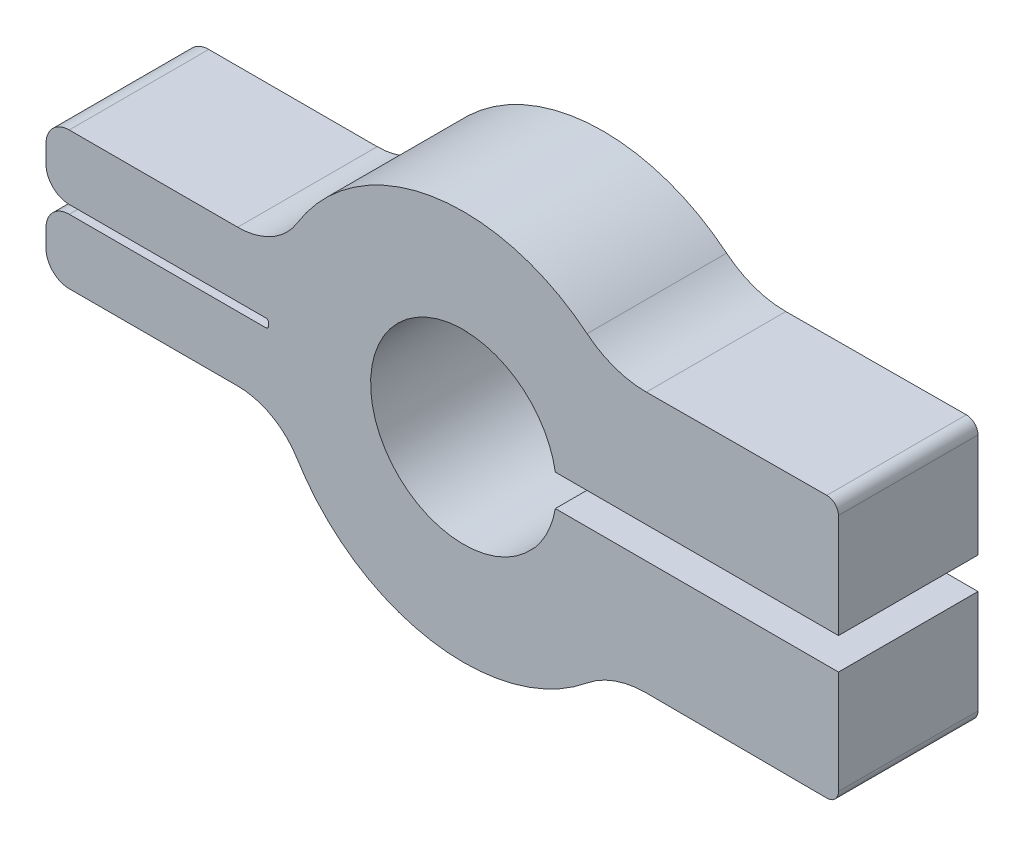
ISO-10303-21;
HEADER;
FILE_DESCRIPTION(('STEP AP214'),'2;1');
FILE_NAME('part.step','',(''),(''),'','','');
FILE_SCHEMA(('AUTOMOTIVE_DESIGN { 1 0 10303 214 1 1 1 1 }'));
ENDSEC;
DATA;
#1=APPLICATION_CONTEXT('core data for automotive mechanical design processes');
#2=APPLICATION_PROTOCOL_DEFINITION('international standard','automotive_design',2000,#1);
#3=PRODUCT_CONTEXT('',#1,'mechanical');
#4=PRODUCT('Part','Part','',(#3));
#5=PRODUCT_RELATED_PRODUCT_CATEGORY('part','',(#4));
#6=PRODUCT_DEFINITION_FORMATION('','',#4);
#7=PRODUCT_DEFINITION_CONTEXT('part definition',#1,'design');
#8=PRODUCT_DEFINITION('design','',#6,#7);
#9=PRODUCT_DEFINITION_SHAPE('','',#8);
#10=(LENGTH_UNIT() NAMED_UNIT(*) SI_UNIT(.MILLI.,.METRE.));
#11=(NAMED_UNIT(*) PLANE_ANGLE_UNIT() SI_UNIT($,.RADIAN.));
#12=(NAMED_UNIT(*) SI_UNIT($,.STERADIAN.) SOLID_ANGLE_UNIT());
#13=UNCERTAINTY_MEASURE_WITH_UNIT(LENGTH_MEASURE(1.E-05),#10,'distance_accuracy_value','');
#14=(GEOMETRIC_REPRESENTATION_CONTEXT(3) GLOBAL_UNCERTAINTY_ASSIGNED_CONTEXT((#13)) GLOBAL_UNIT_ASSIGNED_CONTEXT((#10,
#11,#12)) REPRESENTATION_CONTEXT('',''));
#15=CARTESIAN_POINT('',(0.,0.,0.));
#16=DIRECTION('',(0.,0.,1.));
#17=DIRECTION('',(1.,0.,0.));
#18=AXIS2_PLACEMENT_3D('',#15,#16,#17);
#19=CARTESIAN_POINT('',(-209.618237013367,16.813050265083,6.));
#20=DIRECTION('',(0.,0.,-1.));
#21=DIRECTION('',(-1.,0.,0.));
#22=AXIS2_PLACEMENT_3D('',#19,#20,#21);
#23=CYLINDRICAL_SURFACE('',#22,2.99999999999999);
#24=CARTESIAN_POINT('',(-209.618237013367,16.813050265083,0.));
#25=DIRECTION('',(0.,0.,-1.));
#26=DIRECTION('',(1.,0.,0.));
#27=AXIS2_PLACEMENT_3D('',#24,#25,#26);
#28=CIRCLE('',#27,2.99999999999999);
#29=CARTESIAN_POINT('',(-209.618237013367,19.813050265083,0.));
#30=VERTEX_POINT('',#29);
#31=CARTESIAN_POINT('',(-207.060709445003,18.3811869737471,0.));
#32=VERTEX_POINT('',#31);
#33=EDGE_CURVE('E241',#30,#32,#28,.T.);
#34=ORIENTED_EDGE('',*,*,#33,.T.);
#35=DIRECTION('',(0.,0.,-1.));
#36=VECTOR('',#35,1.);
#37=CARTESIAN_POINT('',(-207.060709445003,18.3811869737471,6.));
#38=LINE('',#37,#36);
#39=CARTESIAN_POINT('',(-207.060709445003,18.3811869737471,6.));
#40=VERTEX_POINT('',#39);
#41=EDGE_CURVE('E11',#40,#32,#38,.T.);
#42=ORIENTED_EDGE('',*,*,#41,.F.);
#43=CARTESIAN_POINT('',(-209.618237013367,16.813050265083,6.));
#44=DIRECTION('',(0.,0.,-1.));
#45=DIRECTION('',(1.,0.,0.));
#46=AXIS2_PLACEMENT_3D('',#43,#44,#45);
#47=CIRCLE('',#46,2.99999999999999);
#48=CARTESIAN_POINT('',(-209.618237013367,19.813050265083,6.));
#49=VERTEX_POINT('',#48);
#50=EDGE_CURVE('E297',#49,#40,#47,.T.);
#51=ORIENTED_EDGE('',*,*,#50,.F.);
#52=DIRECTION('',(0.,0.,-1.));
#53=VECTOR('',#52,1.);
#54=CARTESIAN_POINT('',(-209.618237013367,19.813050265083,6.));
#55=LINE('',#54,#53);
#56=EDGE_CURVE('E237',#49,#30,#55,.T.);
#57=ORIENTED_EDGE('',*,*,#56,.T.);
#58=EDGE_LOOP('',(#34,#42,#51,#57));
#59=FACE_BOUND('',#58,.T.);
#60=ADVANCED_FACE('F33',(#59),#23,.F.);
#61=CARTESIAN_POINT('',(-199.902156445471,22.7704220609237,6.));
#62=DIRECTION('',(0.,0.,-1.));
#63=DIRECTION('',(-1.,0.,0.));
#64=AXIS2_PLACEMENT_3D('',#61,#62,#63);
#65=CYLINDRICAL_SURFACE('',#64,8.39703910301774);
#66=CARTESIAN_POINT('',(-199.902156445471,22.7704220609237,0.));
#67=DIRECTION('',(0.,0.,1.));
#68=DIRECTION('',(1.,0.,0.));
#69=AXIS2_PLACEMENT_3D('',#66,#67,#68);
#70=CIRCLE('',#69,8.39703910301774);
#71=CARTESIAN_POINT('',(-194.591861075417,16.2657292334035,0.));
#72=VERTEX_POINT('',#71);
#73=EDGE_CURVE('E244',#32,#72,#70,.T.);
#74=ORIENTED_EDGE('',*,*,#73,.T.);
#75=DIRECTION('',(0.,0.,-1.));
#76=VECTOR('',#75,1.);
#77=CARTESIAN_POINT('',(-194.591861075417,16.2657292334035,6.));
#78=LINE('',#77,#76);
#79=CARTESIAN_POINT('',(-194.591861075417,16.2657292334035,6.));
#80=VERTEX_POINT('',#79);
#81=EDGE_CURVE('E40',#80,#72,#78,.T.);
#82=ORIENTED_EDGE('',*,*,#81,.F.);
#83=CARTESIAN_POINT('',(-199.902156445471,22.7704220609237,6.));
#84=DIRECTION('',(0.,0.,1.));
#85=DIRECTION('',(1.,0.,0.));
#86=AXIS2_PLACEMENT_3D('',#83,#84,#85);
#87=CIRCLE('',#86,8.39703910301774);
#88=EDGE_CURVE('E147',#40,#80,#87,.T.);
#89=ORIENTED_EDGE('',*,*,#88,.F.);
#90=ORIENTED_EDGE('',*,*,#41,.T.);
#91=EDGE_LOOP('',(#74,#82,#89,#90));
#92=FACE_BOUND('',#91,.T.);
#93=ADVANCED_FACE('F547',(#92),#65,.T.);
#94=CARTESIAN_POINT('',(-192.062257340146,13.1671642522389,6.));
#95=DIRECTION('',(0.,0.,-1.));
#96=DIRECTION('',(-1.,0.,0.));
#97=AXIS2_PLACEMENT_3D('',#94,#95,#96);
#98=CYLINDRICAL_SURFACE('',#97,4.00000000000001);
#99=CARTESIAN_POINT('',(-192.062257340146,13.1671642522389,0.));
#100=DIRECTION('',(0.,0.,-1.));
#101=DIRECTION('',(1.,0.,0.));
#102=AXIS2_PLACEMENT_3D('',#99,#100,#101);
#103=CIRCLE('',#102,4.00000000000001);
#104=CARTESIAN_POINT('',(-192.043882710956,17.1671220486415,0.));
#105=VERTEX_POINT('',#104);
#106=EDGE_CURVE('E247',#72,#105,#103,.T.);
#107=ORIENTED_EDGE('',*,*,#106,.T.);
#108=DIRECTION('',(0.,0.,-1.));
#109=VECTOR('',#108,1.);
#110=CARTESIAN_POINT('',(-192.043882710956,17.1671220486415,6.));
#111=LINE('',#110,#109);
#112=CARTESIAN_POINT('',(-192.043882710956,17.1671220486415,6.));
#113=VERTEX_POINT('',#112);
#114=EDGE_CURVE('E355',#113,#105,#111,.T.);
#115=ORIENTED_EDGE('',*,*,#114,.F.);
#116=CARTESIAN_POINT('',(-192.062257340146,13.1671642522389,6.));
#117=DIRECTION('',(0.,0.,-1.));
#118=DIRECTION('',(1.,0.,0.));
#119=AXIS2_PLACEMENT_3D('',#116,#117,#118);
#120=CIRCLE('',#119,4.00000000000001);
#121=EDGE_CURVE('E363',#80,#113,#120,.T.);
#122=ORIENTED_EDGE('',*,*,#121,.F.);
#123=ORIENTED_EDGE('',*,*,#81,.T.);
#124=EDGE_LOOP('',(#107,#115,#122,#123));
#125=FACE_BOUND('',#124,.T.);
#126=ADVANCED_FACE('F361',(#125),#98,.F.);
#127=CARTESIAN_POINT('',(-184.282501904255,17.1314685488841,6.));
#128=DIRECTION('',(0.00459365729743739,0.999989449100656,0.));
#129=DIRECTION('',(-0.999989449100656,0.00459365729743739,0.));
#130=AXIS2_PLACEMENT_3D('',#127,#128,#129);
#131=PLANE('',#130);
#132=DIRECTION('',(0.999989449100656,-0.00459365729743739,0.));
#133=VECTOR('',#132,1.);
#134=CARTESIAN_POINT('',(-184.282501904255,17.1314685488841,0.));
#135=LINE('',#134,#133);
#136=CARTESIAN_POINT('',(-184.282501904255,17.1314685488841,0.));
#137=VERTEX_POINT('',#136);
#138=EDGE_CURVE('E249',#105,#137,#135,.T.);
#139=ORIENTED_EDGE('',*,*,#138,.T.);
#140=DIRECTION('',(0.,0.,-1.));
#141=VECTOR('',#140,1.);
#142=CARTESIAN_POINT('',(-184.282501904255,17.1314685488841,6.));
#143=LINE('',#142,#141);
#144=CARTESIAN_POINT('',(-184.282501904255,17.1314685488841,6.));
#145=VERTEX_POINT('',#144);
#146=EDGE_CURVE('E352',#145,#137,#143,.T.);
#147=ORIENTED_EDGE('',*,*,#146,.F.);
#148=DIRECTION('',(0.999989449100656,-0.00459365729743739,0.));
#149=VECTOR('',#148,1.);
#150=CARTESIAN_POINT('',(-184.282501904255,17.1314685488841,6.));
#151=LINE('',#150,#149);
#152=EDGE_CURVE('E382',#113,#145,#151,.T.);
#153=ORIENTED_EDGE('',*,*,#152,.F.);
#154=ORIENTED_EDGE('',*,*,#114,.T.);
#155=EDGE_LOOP('',(#139,#147,#153,#154));
#156=FACE_BOUND('',#155,.T.);
#157=ADVANCED_FACE('F373',(#156),#131,.F.);
#158=CARTESIAN_POINT('',(-184.280205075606,17.6314632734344,6.));
#159=DIRECTION('',(0.,0.,-1.));
#160=DIRECTION('',(-1.,0.,0.));
#161=AXIS2_PLACEMENT_3D('',#158,#159,#160);
#162=CYLINDRICAL_SURFACE('',#161,0.499999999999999);
#163=CARTESIAN_POINT('',(-184.280205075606,17.6314632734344,0.));
#164=DIRECTION('',(0.,0.,1.));
#165=DIRECTION('',(-1.,0.,0.));
#166=AXIS2_PLACEMENT_3D('',#163,#164,#165);
#167=CIRCLE('',#166,0.499999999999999);
#168=CARTESIAN_POINT('',(-183.780205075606,17.6314632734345,0.));
#169=VERTEX_POINT('',#168);
#170=EDGE_CURVE('E251',#137,#169,#167,.T.);
#171=ORIENTED_EDGE('',*,*,#170,.T.);
#172=DIRECTION('',(0.,0.,-1.));
#173=VECTOR('',#172,1.);
#174=CARTESIAN_POINT('',(-183.780205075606,17.6314632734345,6.));
#175=LINE('',#174,#173);
#176=CARTESIAN_POINT('',(-183.780205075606,17.6314632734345,6.));
#177=VERTEX_POINT('',#176);
#178=EDGE_CURVE('E349',#177,#169,#175,.T.);
#179=ORIENTED_EDGE('',*,*,#178,.F.);
#180=CARTESIAN_POINT('',(-184.280205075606,17.6314632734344,6.));
#181=DIRECTION('',(0.,0.,1.));
#182=DIRECTION('',(-1.,0.,0.));
#183=AXIS2_PLACEMENT_3D('',#180,#181,#182);
#184=CIRCLE('',#183,0.499999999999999);
#185=EDGE_CURVE('E379',#145,#177,#184,.T.);
#186=ORIENTED_EDGE('',*,*,#185,.F.);
#187=ORIENTED_EDGE('',*,*,#146,.T.);
#188=EDGE_LOOP('',(#171,#179,#186,#187));
#189=FACE_BOUND('',#188,.T.);
#190=ADVANCED_FACE('F377',(#189),#162,.T.);
#191=CARTESIAN_POINT('',(-183.780205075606,19.9342487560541,6.));
#192=DIRECTION('',(-1.,0.,0.));
#193=DIRECTION('',(0.,0.,1.));
#194=AXIS2_PLACEMENT_3D('',#191,#192,#193);
#195=PLANE('',#194);
#196=DIRECTION('',(0.,1.,0.));
#197=VECTOR('',#196,1.);
#198=CARTESIAN_POINT('',(-183.780205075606,19.9342487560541,0.));
#199=LINE('',#198,#197);
#200=CARTESIAN_POINT('',(-183.780205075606,22.0795355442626,0.));
#201=VERTEX_POINT('',#200);
#202=EDGE_CURVE('E253',#169,#201,#199,.T.);
#203=ORIENTED_EDGE('',*,*,#202,.T.);
#204=DIRECTION('',(0.,0.,1.));
#205=VECTOR('',#204,1.);
#206=CARTESIAN_POINT('',(-183.780205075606,22.0795355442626,0.));
#207=LINE('',#206,#205);
#208=CARTESIAN_POINT('',(-183.780205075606,22.0795355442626,6.00000000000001));
#209=VERTEX_POINT('',#208);
#210=EDGE_CURVE('E471',#201,#209,#207,.T.);
#211=ORIENTED_EDGE('',*,*,#210,.T.);
#212=DIRECTION('',(0.,1.,0.));
#213=VECTOR('',#212,1.);
#214=CARTESIAN_POINT('',(-183.780205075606,19.9342487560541,6.));
#215=LINE('',#214,#213);
#216=EDGE_CURVE('E381',#177,#209,#215,.T.);
#217=ORIENTED_EDGE('',*,*,#216,.F.);
#218=ORIENTED_EDGE('',*,*,#178,.T.);
#219=EDGE_LOOP('',(#203,#211,#217,#218));
#220=FACE_BOUND('',#219,.T.);
#221=ADVANCED_FACE('F537',(#220),#195,.F.);
#222=CARTESIAN_POINT('',(-196.17791857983,19.4342487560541,6.));
#223=DIRECTION('',(0.,0.,-1.));
#224=DIRECTION('',(-1.,0.,0.));
#225=AXIS2_PLACEMENT_3D('',#222,#223,#224);
#226=CYLINDRICAL_SURFACE('',#225,0.999999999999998);
#227=CARTESIAN_POINT('',(-196.17791857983,19.4342487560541,6.));
#228=DIRECTION('',(0.,0.,1.));
#229=DIRECTION('',(1.,0.,0.));
#230=AXIS2_PLACEMENT_3D('',#227,#228,#229);
#231=CIRCLE('',#230,0.999999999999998);
#232=CARTESIAN_POINT('',(-196.830863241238,20.1916543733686,6.));
#233=VERTEX_POINT('',#232);
#234=CARTESIAN_POINT('',(-196.922766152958,20.101483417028,6.));
#235=VERTEX_POINT('',#234);
#236=EDGE_CURVE('E384',#233,#235,#231,.T.);
#237=ORIENTED_EDGE('',*,*,#236,.F.);
#238=DIRECTION('',(0.,0.,1.));
#239=VECTOR('',#238,1.);
#240=CARTESIAN_POINT('',(-196.830863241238,20.1916543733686,3.00000000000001));
#241=LINE('',#240,#239);
#242=CARTESIAN_POINT('',(-196.830863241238,20.1916543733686,0.));
#243=VERTEX_POINT('',#242);
#244=EDGE_CURVE('E461',#233,#243,#241,.F.);
#245=ORIENTED_EDGE('',*,*,#244,.T.);
#246=CARTESIAN_POINT('',(-196.17791857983,19.4342487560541,0.));
#247=DIRECTION('',(0.,0.,1.));
#248=DIRECTION('',(1.,0.,0.));
#249=AXIS2_PLACEMENT_3D('',#246,#247,#248);
#250=CIRCLE('',#249,0.999999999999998);
#251=CARTESIAN_POINT('',(-196.922766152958,20.101483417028,0.));
#252=VERTEX_POINT('',#251);
#253=EDGE_CURVE('E256',#243,#252,#250,.T.);
#254=ORIENTED_EDGE('',*,*,#253,.T.);
#255=DIRECTION('',(0.,0.,-1.));
#256=VECTOR('',#255,1.);
#257=CARTESIAN_POINT('',(-196.922766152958,20.101483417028,6.));
#258=LINE('',#257,#256);
#259=EDGE_CURVE('E346',#235,#252,#258,.T.);
#260=ORIENTED_EDGE('',*,*,#259,.F.);
#261=EDGE_LOOP('',(#237,#245,#254,#260));
#262=FACE_BOUND('',#261,.T.);
#263=ADVANCED_FACE('F534',(#262),#226,.T.);
#264=CARTESIAN_POINT('',(-199.902156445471,22.7704220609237,6.));
#265=DIRECTION('',(0.,0.,-1.));
#266=DIRECTION('',(-1.,0.,0.));
#267=AXIS2_PLACEMENT_3D('',#264,#265,#266);
#268=CYLINDRICAL_SURFACE('',#267,4.00000000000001);
#269=CARTESIAN_POINT('',(-199.902156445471,22.7704220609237,0.));
#270=DIRECTION('',(0.,0.,-1.));
#271=DIRECTION('',(1.,0.,0.));
#272=AXIS2_PLACEMENT_3D('',#269,#270,#271);
#273=CIRCLE('',#272,4.00000000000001);
#274=CARTESIAN_POINT('',(-199.587010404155,26.7579881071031,0.));
#275=VERTEX_POINT('',#274);
#276=EDGE_CURVE('E258',#252,#275,#273,.T.);
#277=ORIENTED_EDGE('',*,*,#276,.T.);
#278=DIRECTION('',(0.,0.,-1.));
#279=VECTOR('',#278,1.);
#280=CARTESIAN_POINT('',(-199.587010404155,26.7579881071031,6.));
#281=LINE('',#280,#279);
#282=CARTESIAN_POINT('',(-199.587010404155,26.7579881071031,6.00000000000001));
#283=VERTEX_POINT('',#282);
#284=EDGE_CURVE('E245',#275,#283,#281,.F.);
#285=ORIENTED_EDGE('',*,*,#284,.T.);
#286=CARTESIAN_POINT('',(-199.902156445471,22.7704220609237,6.));
#287=DIRECTION('',(0.,0.,-1.));
#288=DIRECTION('',(1.,0.,0.));
#289=AXIS2_PLACEMENT_3D('',#286,#287,#288);
#290=CIRCLE('',#289,4.00000000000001);
#291=EDGE_CURVE('E390',#235,#283,#290,.T.);
#292=ORIENTED_EDGE('',*,*,#291,.F.);
#293=ORIENTED_EDGE('',*,*,#259,.T.);
#294=EDGE_LOOP('',(#277,#285,#292,#293));
#295=FACE_BOUND('',#294,.T.);
#296=ADVANCED_FACE('F530',(#295),#268,.F.);
#297=CARTESIAN_POINT('',(-183.780205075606,27.9093808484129,6.));
#298=DIRECTION('',(-1.,0.,0.));
#299=DIRECTION('',(0.,0.,1.));
#300=AXIS2_PLACEMENT_3D('',#297,#298,#299);
#301=PLANE('',#300);
#302=DIRECTION('',(0.,0.,-1.));
#303=VECTOR('',#302,1.);
#304=CARTESIAN_POINT('',(-183.780205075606,27.9093808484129,6.));
#305=LINE('',#304,#303);
#306=CARTESIAN_POINT('',(-183.780205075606,27.9093808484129,6.));
#307=VERTEX_POINT('',#306);
#308=CARTESIAN_POINT('',(-183.780205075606,27.9093808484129,0.));
#309=VERTEX_POINT('',#308);
#310=EDGE_CURVE('E343',#307,#309,#305,.T.);
#311=ORIENTED_EDGE('',*,*,#310,.F.);
#312=DIRECTION('',(0.,1.,0.));
#313=VECTOR('',#312,1.);
#314=CARTESIAN_POINT('',(-183.780205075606,27.9093808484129,6.));
#315=LINE('',#314,#313);
#316=CARTESIAN_POINT('',(-183.780205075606,23.4364406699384,6.00000000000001));
#317=VERTEX_POINT('',#316);
#318=EDGE_CURVE('E393',#317,#307,#315,.T.);
#319=ORIENTED_EDGE('',*,*,#318,.F.);
#320=DIRECTION('',(0.,0.,1.));
#321=VECTOR('',#320,1.);
#322=CARTESIAN_POINT('',(-183.780205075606,23.4364406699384,0.));
#323=LINE('',#322,#321);
#324=CARTESIAN_POINT('',(-183.780205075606,23.4364406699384,0.));
#325=VERTEX_POINT('',#324);
#326=EDGE_CURVE('E445',#325,#317,#323,.T.);
#327=ORIENTED_EDGE('',*,*,#326,.F.);
#328=DIRECTION('',(0.,1.,0.));
#329=VECTOR('',#328,1.);
#330=CARTESIAN_POINT('',(-183.780205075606,27.9093808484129,0.));
#331=LINE('',#330,#329);
#332=EDGE_CURVE('E261',#325,#309,#331,.T.);
#333=ORIENTED_EDGE('',*,*,#332,.T.);
#334=EDGE_LOOP('',(#311,#319,#327,#333));
#335=FACE_BOUND('',#334,.T.);
#336=ADVANCED_FACE('F577',(#335),#301,.F.);
#337=CARTESIAN_POINT('',(-184.280205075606,27.9093808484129,6.));
#338=DIRECTION('',(0.,0.,-1.));
#339=DIRECTION('',(-1.,0.,0.));
#340=AXIS2_PLACEMENT_3D('',#337,#338,#339);
#341=CYLINDRICAL_SURFACE('',#340,0.499999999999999);
#342=CARTESIAN_POINT('',(-184.280205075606,27.9093808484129,0.));
#343=DIRECTION('',(0.,0.,1.));
#344=DIRECTION('',(1.,0.,0.));
#345=AXIS2_PLACEMENT_3D('',#342,#343,#344);
#346=CIRCLE('',#345,0.499999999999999);
#347=CARTESIAN_POINT('',(-184.282501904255,28.4093755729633,0.));
#348=VERTEX_POINT('',#347);
#349=EDGE_CURVE('E263',#309,#348,#346,.T.);
#350=ORIENTED_EDGE('',*,*,#349,.T.);
#351=DIRECTION('',(0.,0.,-1.));
#352=VECTOR('',#351,1.);
#353=CARTESIAN_POINT('',(-184.282501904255,28.4093755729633,6.));
#354=LINE('',#353,#352);
#355=CARTESIAN_POINT('',(-184.282501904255,28.4093755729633,6.));
#356=VERTEX_POINT('',#355);
#357=EDGE_CURVE('E340',#356,#348,#354,.T.);
#358=ORIENTED_EDGE('',*,*,#357,.F.);
#359=CARTESIAN_POINT('',(-184.280205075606,27.9093808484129,6.));
#360=DIRECTION('',(0.,0.,1.));
#361=DIRECTION('',(1.,0.,0.));
#362=AXIS2_PLACEMENT_3D('',#359,#360,#361);
#363=CIRCLE('',#362,0.499999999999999);
#364=EDGE_CURVE('E395',#307,#356,#363,.T.);
#365=ORIENTED_EDGE('',*,*,#364,.F.);
#366=ORIENTED_EDGE('',*,*,#310,.T.);
#367=EDGE_LOOP('',(#350,#358,#365,#366));
#368=FACE_BOUND('',#367,.T.);
#369=ADVANCED_FACE('F571',(#368),#341,.T.);
#370=CARTESIAN_POINT('',(-192.043882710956,28.3737220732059,6.));
#371=DIRECTION('',(0.00459365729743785,-0.999989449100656,0.));
#372=DIRECTION('',(0.999989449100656,0.00459365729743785,0.));
#373=AXIS2_PLACEMENT_3D('',#370,#371,#372);
#374=PLANE('',#373);
#375=DIRECTION('',(-0.999989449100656,-0.00459365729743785,0.));
#376=VECTOR('',#375,1.);
#377=CARTESIAN_POINT('',(-192.043882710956,28.3737220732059,0.));
#378=LINE('',#377,#376);
#379=CARTESIAN_POINT('',(-192.043882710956,28.3737220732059,0.));
#380=VERTEX_POINT('',#379);
#381=EDGE_CURVE('E265',#348,#380,#378,.T.);
#382=ORIENTED_EDGE('',*,*,#381,.T.);
#383=DIRECTION('',(0.,0.,-1.));
#384=VECTOR('',#383,1.);
#385=CARTESIAN_POINT('',(-192.043882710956,28.3737220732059,6.));
#386=LINE('',#385,#384);
#387=CARTESIAN_POINT('',(-192.043882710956,28.3737220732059,6.));
#388=VERTEX_POINT('',#387);
#389=EDGE_CURVE('E337',#388,#380,#386,.T.);
#390=ORIENTED_EDGE('',*,*,#389,.F.);
#391=DIRECTION('',(-0.999989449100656,-0.00459365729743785,0.));
#392=VECTOR('',#391,1.);
#393=CARTESIAN_POINT('',(-192.043882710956,28.3737220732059,6.));
#394=LINE('',#393,#392);
#395=EDGE_CURVE('E397',#356,#388,#394,.T.);
#396=ORIENTED_EDGE('',*,*,#395,.F.);
#397=ORIENTED_EDGE('',*,*,#357,.T.);
#398=EDGE_LOOP('',(#382,#390,#396,#397));
#399=FACE_BOUND('',#398,.T.);
#400=ADVANCED_FACE('F576',(#399),#374,.F.);
#401=CARTESIAN_POINT('',(-192.062257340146,32.3736798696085,6.));
#402=DIRECTION('',(0.,0.,-1.));
#403=DIRECTION('',(-1.,0.,0.));
#404=AXIS2_PLACEMENT_3D('',#401,#402,#403);
#405=CYLINDRICAL_SURFACE('',#404,4.);
#406=CARTESIAN_POINT('',(-192.062257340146,32.3736798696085,0.));
#407=DIRECTION('',(0.,0.,-1.));
#408=DIRECTION('',(-1.,0.,0.));
#409=AXIS2_PLACEMENT_3D('',#406,#407,#408);
#410=CIRCLE('',#409,4.);
#411=CARTESIAN_POINT('',(-194.591861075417,29.2751148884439,0.));
#412=VERTEX_POINT('',#411);
#413=EDGE_CURVE('E267',#380,#412,#410,.T.);
#414=ORIENTED_EDGE('',*,*,#413,.T.);
#415=DIRECTION('',(0.,0.,-1.));
#416=VECTOR('',#415,1.);
#417=CARTESIAN_POINT('',(-194.591861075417,29.2751148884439,6.));
#418=LINE('',#417,#416);
#419=CARTESIAN_POINT('',(-194.591861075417,29.2751148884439,6.));
#420=VERTEX_POINT('',#419);
#421=EDGE_CURVE('E334',#420,#412,#418,.T.);
#422=ORIENTED_EDGE('',*,*,#421,.F.);
#423=CARTESIAN_POINT('',(-192.062257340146,32.3736798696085,6.));
#424=DIRECTION('',(0.,0.,-1.));
#425=DIRECTION('',(-1.,0.,0.));
#426=AXIS2_PLACEMENT_3D('',#423,#424,#425);
#427=CIRCLE('',#426,4.);
#428=EDGE_CURVE('E399',#388,#420,#427,.T.);
#429=ORIENTED_EDGE('',*,*,#428,.F.);
#430=ORIENTED_EDGE('',*,*,#389,.T.);
#431=EDGE_LOOP('',(#414,#422,#429,#430));
#432=FACE_BOUND('',#431,.T.);
#433=ADVANCED_FACE('F589',(#432),#405,.F.);
#434=CARTESIAN_POINT('',(-199.902156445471,22.7704220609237,6.));
#435=DIRECTION('',(0.,0.,-1.));
#436=DIRECTION('',(-1.,0.,0.));
#437=AXIS2_PLACEMENT_3D('',#434,#435,#436);
#438=CYLINDRICAL_SURFACE('',#437,8.39703910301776);
#439=CARTESIAN_POINT('',(-199.902156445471,22.7704220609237,0.));
#440=DIRECTION('',(0.,0.,1.));
#441=DIRECTION('',(1.,0.,0.));
#442=AXIS2_PLACEMENT_3D('',#439,#440,#441);
#443=CIRCLE('',#442,8.39703910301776);
#444=CARTESIAN_POINT('',(-207.060709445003,27.1596571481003,0.));
#445=VERTEX_POINT('',#444);
#446=EDGE_CURVE('E269',#412,#445,#443,.T.);
#447=ORIENTED_EDGE('',*,*,#446,.T.);
#448=DIRECTION('',(0.,0.,-1.));
#449=VECTOR('',#448,1.);
#450=CARTESIAN_POINT('',(-207.060709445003,27.1596571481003,6.));
#451=LINE('',#450,#449);
#452=CARTESIAN_POINT('',(-207.060709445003,27.1596571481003,6.));
#453=VERTEX_POINT('',#452);
#454=EDGE_CURVE('E331',#453,#445,#451,.T.);
#455=ORIENTED_EDGE('',*,*,#454,.F.);
#456=CARTESIAN_POINT('',(-199.902156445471,22.7704220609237,6.));
#457=DIRECTION('',(0.,0.,1.));
#458=DIRECTION('',(1.,0.,0.));
#459=AXIS2_PLACEMENT_3D('',#456,#457,#458);
#460=CIRCLE('',#459,8.39703910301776);
#461=EDGE_CURVE('E401',#420,#453,#460,.T.);
#462=ORIENTED_EDGE('',*,*,#461,.F.);
#463=ORIENTED_EDGE('',*,*,#421,.T.);
#464=EDGE_LOOP('',(#447,#455,#462,#463));
#465=FACE_BOUND('',#464,.T.);
#466=ADVANCED_FACE('F599',(#465),#438,.T.);
#467=CARTESIAN_POINT('',(-209.618237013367,28.7277938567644,6.));
#468=DIRECTION('',(0.,0.,-1.));
#469=DIRECTION('',(-1.,0.,0.));
#470=AXIS2_PLACEMENT_3D('',#467,#468,#469);
#471=CYLINDRICAL_SURFACE('',#470,3.);
#472=CARTESIAN_POINT('',(-209.618237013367,28.7277938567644,0.));
#473=DIRECTION('',(0.,0.,-1.));
#474=DIRECTION('',(-1.,0.,0.));
#475=AXIS2_PLACEMENT_3D('',#472,#473,#474);
#476=CIRCLE('',#475,3.);
#477=CARTESIAN_POINT('',(-209.618237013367,25.7277938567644,0.));
#478=VERTEX_POINT('',#477);
#479=EDGE_CURVE('E271',#445,#478,#476,.T.);
#480=ORIENTED_EDGE('',*,*,#479,.T.);
#481=DIRECTION('',(0.,0.,-1.));
#482=VECTOR('',#481,1.);
#483=CARTESIAN_POINT('',(-209.618237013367,25.7277938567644,6.));
#484=LINE('',#483,#482);
#485=CARTESIAN_POINT('',(-209.618237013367,25.7277938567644,6.));
#486=VERTEX_POINT('',#485);
#487=EDGE_CURVE('E328',#486,#478,#484,.T.);
#488=ORIENTED_EDGE('',*,*,#487,.F.);
#489=CARTESIAN_POINT('',(-209.618237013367,28.7277938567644,6.));
#490=DIRECTION('',(0.,0.,-1.));
#491=DIRECTION('',(-1.,0.,0.));
#492=AXIS2_PLACEMENT_3D('',#489,#490,#491);
#493=CIRCLE('',#492,3.);
#494=EDGE_CURVE('E403',#453,#486,#493,.T.);
#495=ORIENTED_EDGE('',*,*,#494,.F.);
#496=ORIENTED_EDGE('',*,*,#454,.T.);
#497=EDGE_LOOP('',(#480,#488,#495,#496));
#498=FACE_BOUND('',#497,.T.);
#499=ADVANCED_FACE('F609',(#498),#471,.F.);
#500=CARTESIAN_POINT('',(-216.861680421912,25.7277938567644,6.));
#501=DIRECTION('',(0.,-1.,0.));
#502=DIRECTION('',(0.,0.,-1.));
#503=AXIS2_PLACEMENT_3D('',#500,#501,#502);
#504=PLANE('',#503);
#505=DIRECTION('',(-1.,0.,0.));
#506=VECTOR('',#505,1.);
#507=CARTESIAN_POINT('',(-216.861680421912,25.7277938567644,0.));
#508=LINE('',#507,#506);
#509=CARTESIAN_POINT('',(-216.861680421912,25.7277938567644,0.));
#510=VERTEX_POINT('',#509);
#511=EDGE_CURVE('E273',#478,#510,#508,.T.);
#512=ORIENTED_EDGE('',*,*,#511,.T.);
#513=DIRECTION('',(0.,0.,-1.));
#514=VECTOR('',#513,1.);
#515=CARTESIAN_POINT('',(-216.861680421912,25.7277938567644,6.));
#516=LINE('',#515,#514);
#517=CARTESIAN_POINT('',(-216.861680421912,25.7277938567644,6.));
#518=VERTEX_POINT('',#517);
#519=EDGE_CURVE('E325',#518,#510,#516,.T.);
#520=ORIENTED_EDGE('',*,*,#519,.F.);
#521=DIRECTION('',(-1.,0.,0.));
#522=VECTOR('',#521,1.);
#523=CARTESIAN_POINT('',(-216.861680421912,25.7277938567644,6.));
#524=LINE('',#523,#522);
#525=EDGE_CURVE('E405',#486,#518,#524,.T.);
#526=ORIENTED_EDGE('',*,*,#525,.F.);
#527=ORIENTED_EDGE('',*,*,#487,.T.);
#528=EDGE_LOOP('',(#512,#520,#526,#527));
#529=FACE_BOUND('',#528,.T.);
#530=ADVANCED_FACE('F619',(#529),#504,.F.);
#531=CARTESIAN_POINT('',(-216.861680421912,24.7277938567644,6.));
#532=DIRECTION('',(0.,0.,-1.));
#533=DIRECTION('',(-1.,0.,0.));
#534=AXIS2_PLACEMENT_3D('',#531,#532,#533);
#535=CYLINDRICAL_SURFACE('',#534,1.);
#536=CARTESIAN_POINT('',(-216.861680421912,24.7277938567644,0.));
#537=DIRECTION('',(0.,0.,1.));
#538=DIRECTION('',(1.,0.,0.));
#539=AXIS2_PLACEMENT_3D('',#536,#537,#538);
#540=CIRCLE('',#539,1.);
#541=CARTESIAN_POINT('',(-217.861680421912,24.7277938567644,0.));
#542=VERTEX_POINT('',#541);
#543=EDGE_CURVE('E275',#510,#542,#540,.T.);
#544=ORIENTED_EDGE('',*,*,#543,.T.);
#545=DIRECTION('',(0.,0.,-1.));
#546=VECTOR('',#545,1.);
#547=CARTESIAN_POINT('',(-217.861680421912,24.7277938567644,6.));
#548=LINE('',#547,#546);
#549=CARTESIAN_POINT('',(-217.861680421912,24.7277938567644,6.));
#550=VERTEX_POINT('',#549);
#551=EDGE_CURVE('E322',#550,#542,#548,.T.);
#552=ORIENTED_EDGE('',*,*,#551,.F.);
#553=CARTESIAN_POINT('',(-216.861680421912,24.7277938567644,6.));
#554=DIRECTION('',(0.,0.,1.));
#555=DIRECTION('',(1.,0.,0.));
#556=AXIS2_PLACEMENT_3D('',#553,#554,#555);
#557=CIRCLE('',#556,1.);
#558=EDGE_CURVE('E407',#518,#550,#557,.T.);
#559=ORIENTED_EDGE('',*,*,#558,.F.);
#560=ORIENTED_EDGE('',*,*,#519,.T.);
#561=EDGE_LOOP('',(#544,#552,#559,#560));
#562=FACE_BOUND('',#561,.T.);
#563=ADVANCED_FACE('F629',(#562),#535,.T.);
#564=CARTESIAN_POINT('',(-217.861680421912,23.952622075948,6.));
#565=DIRECTION('',(1.,0.,0.));
#566=DIRECTION('',(0.,0.,-1.));
#567=AXIS2_PLACEMENT_3D('',#564,#565,#566);
#568=PLANE('',#567);
#569=DIRECTION('',(0.,-1.,0.));
#570=VECTOR('',#569,1.);
#571=CARTESIAN_POINT('',(-217.861680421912,23.952622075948,0.));
#572=LINE('',#571,#570);
#573=CARTESIAN_POINT('',(-217.861680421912,23.952622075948,0.));
#574=VERTEX_POINT('',#573);
#575=EDGE_CURVE('E277',#542,#574,#572,.T.);
#576=ORIENTED_EDGE('',*,*,#575,.T.);
#577=DIRECTION('',(0.,0.,-1.));
#578=VECTOR('',#577,1.);
#579=CARTESIAN_POINT('',(-217.861680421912,23.952622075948,6.));
#580=LINE('',#579,#578);
#581=CARTESIAN_POINT('',(-217.861680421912,23.952622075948,6.));
#582=VERTEX_POINT('',#581);
#583=EDGE_CURVE('E319',#582,#574,#580,.T.);
#584=ORIENTED_EDGE('',*,*,#583,.F.);
#585=DIRECTION('',(0.,-1.,0.));
#586=VECTOR('',#585,1.);
#587=CARTESIAN_POINT('',(-217.861680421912,23.952622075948,6.));
#588=LINE('',#587,#586);
#589=EDGE_CURVE('E409',#550,#582,#588,.T.);
#590=ORIENTED_EDGE('',*,*,#589,.F.);
#591=ORIENTED_EDGE('',*,*,#551,.T.);
#592=EDGE_LOOP('',(#576,#584,#590,#591));
#593=FACE_BOUND('',#592,.T.);
#594=ADVANCED_FACE('F639',(#593),#568,.F.);
#595=CARTESIAN_POINT('',(-216.861680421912,23.952622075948,6.));
#596=DIRECTION('',(0.,0.,-1.));
#597=DIRECTION('',(-1.,0.,0.));
#598=AXIS2_PLACEMENT_3D('',#595,#596,#597);
#599=CYLINDRICAL_SURFACE('',#598,1.);
#600=CARTESIAN_POINT('',(-216.861680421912,23.952622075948,0.));
#601=DIRECTION('',(0.,0.,1.));
#602=DIRECTION('',(-1.,0.,0.));
#603=AXIS2_PLACEMENT_3D('',#600,#601,#602);
#604=CIRCLE('',#603,1.);
#605=CARTESIAN_POINT('',(-216.861680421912,22.952622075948,0.));
#606=VERTEX_POINT('',#605);
#607=EDGE_CURVE('E279',#574,#606,#604,.T.);
#608=ORIENTED_EDGE('',*,*,#607,.T.);
#609=DIRECTION('',(0.,0.,-1.));
#610=VECTOR('',#609,1.);
#611=CARTESIAN_POINT('',(-216.861680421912,22.952622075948,6.));
#612=LINE('',#611,#610);
#613=CARTESIAN_POINT('',(-216.861680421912,22.952622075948,6.));
#614=VERTEX_POINT('',#613);
#615=EDGE_CURVE('E316',#614,#606,#612,.T.);
#616=ORIENTED_EDGE('',*,*,#615,.F.);
#617=CARTESIAN_POINT('',(-216.861680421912,23.952622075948,6.));
#618=DIRECTION('',(0.,0.,1.));
#619=DIRECTION('',(-1.,0.,0.));
#620=AXIS2_PLACEMENT_3D('',#617,#618,#619);
#621=CIRCLE('',#620,1.);
#622=EDGE_CURVE('E411',#582,#614,#621,.T.);
#623=ORIENTED_EDGE('',*,*,#622,.F.);
#624=ORIENTED_EDGE('',*,*,#583,.T.);
#625=EDGE_LOOP('',(#608,#616,#623,#624));
#626=FACE_BOUND('',#625,.T.);
#627=ADVANCED_FACE('F649',(#626),#599,.T.);
#628=CARTESIAN_POINT('',(-216.861680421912,22.952622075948,6.));
#629=DIRECTION('',(0.,1.,0.));
#630=DIRECTION('',(0.,0.,1.));
#631=AXIS2_PLACEMENT_3D('',#628,#629,#630);
#632=PLANE('',#631);
#633=DIRECTION('',(1.,0.,0.));
#634=VECTOR('',#633,1.);
#635=CARTESIAN_POINT('',(-216.861680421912,22.952622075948,0.));
#636=LINE('',#635,#634);
#637=CARTESIAN_POINT('',(-208.398797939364,22.952622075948,0.));
#638=VERTEX_POINT('',#637);
#639=EDGE_CURVE('E281',#606,#638,#636,.T.);
#640=ORIENTED_EDGE('',*,*,#639,.T.);
#641=DIRECTION('',(0.,0.,-1.));
#642=VECTOR('',#641,1.);
#643=CARTESIAN_POINT('',(-208.398797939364,22.952622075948,6.));
#644=LINE('',#643,#642);
#645=CARTESIAN_POINT('',(-208.398797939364,22.952622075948,6.));
#646=VERTEX_POINT('',#645);
#647=EDGE_CURVE('E313',#646,#638,#644,.T.);
#648=ORIENTED_EDGE('',*,*,#647,.F.);
#649=DIRECTION('',(1.,0.,0.));
#650=VECTOR('',#649,1.);
#651=CARTESIAN_POINT('',(-216.861680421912,22.952622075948,6.));
#652=LINE('',#651,#650);
#653=EDGE_CURVE('E413',#614,#646,#652,.T.);
#654=ORIENTED_EDGE('',*,*,#653,.F.);
#655=ORIENTED_EDGE('',*,*,#615,.T.);
#656=EDGE_LOOP('',(#640,#648,#654,#655));
#657=FACE_BOUND('',#656,.T.);
#658=ADVANCED_FACE('F659',(#657),#632,.F.);
#659=CARTESIAN_POINT('',(-208.398797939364,22.852622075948,6.));
#660=DIRECTION('',(0.,0.,-1.));
#661=DIRECTION('',(-1.,0.,0.));
#662=AXIS2_PLACEMENT_3D('',#659,#660,#661);
#663=CYLINDRICAL_SURFACE('',#662,0.100000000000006);
#664=CARTESIAN_POINT('',(-208.398797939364,22.852622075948,0.));
#665=DIRECTION('',(0.,0.,-1.));
#666=DIRECTION('',(1.,0.,0.));
#667=AXIS2_PLACEMENT_3D('',#664,#665,#666);
#668=CIRCLE('',#667,0.100000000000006);
#669=CARTESIAN_POINT('',(-208.298802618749,22.8516546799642,0.));
#670=VERTEX_POINT('',#669);
#671=EDGE_CURVE('E283',#638,#670,#668,.T.);
#672=ORIENTED_EDGE('',*,*,#671,.T.);
#673=DIRECTION('',(0.,0.,-1.));
#674=VECTOR('',#673,1.);
#675=CARTESIAN_POINT('',(-208.298802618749,22.8516546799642,6.));
#676=LINE('',#675,#674);
#677=CARTESIAN_POINT('',(-208.298802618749,22.8516546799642,6.));
#678=VERTEX_POINT('',#677);
#679=EDGE_CURVE('E310',#678,#670,#676,.T.);
#680=ORIENTED_EDGE('',*,*,#679,.F.);
#681=CARTESIAN_POINT('',(-208.398797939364,22.852622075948,6.));
#682=DIRECTION('',(0.,0.,-1.));
#683=DIRECTION('',(1.,0.,0.));
#684=AXIS2_PLACEMENT_3D('',#681,#682,#683);
#685=CIRCLE('',#684,0.100000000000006);
#686=EDGE_CURVE('E415',#646,#678,#685,.T.);
#687=ORIENTED_EDGE('',*,*,#686,.F.);
#688=ORIENTED_EDGE('',*,*,#647,.T.);
#689=EDGE_LOOP('',(#672,#680,#687,#688));
#690=FACE_BOUND('',#689,.T.);
#691=ADVANCED_FACE('F669',(#690),#663,.F.);
#692=CARTESIAN_POINT('',(-199.902156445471,22.7704220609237,6.));
#693=DIRECTION('',(0.,0.,-1.));
#694=DIRECTION('',(-1.,0.,0.));
#695=AXIS2_PLACEMENT_3D('',#692,#693,#694);
#696=CYLINDRICAL_SURFACE('',#695,8.39703910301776);
#697=CARTESIAN_POINT('',(-199.902156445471,22.7704220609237,0.));
#698=DIRECTION('',(0.,0.,1.));
#699=DIRECTION('',(1.,0.,0.));
#700=AXIS2_PLACEMENT_3D('',#697,#698,#699);
#701=CIRCLE('',#700,8.39703910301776);
#702=CARTESIAN_POINT('',(-208.298802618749,22.6891894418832,0.));
#703=VERTEX_POINT('',#702);
#704=EDGE_CURVE('E285',#670,#703,#701,.T.);
#705=ORIENTED_EDGE('',*,*,#704,.T.);
#706=DIRECTION('',(0.,0.,-1.));
#707=VECTOR('',#706,1.);
#708=CARTESIAN_POINT('',(-208.298802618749,22.6891894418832,6.));
#709=LINE('',#708,#707);
#710=CARTESIAN_POINT('',(-208.298802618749,22.6891894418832,6.));
#711=VERTEX_POINT('',#710);
#712=EDGE_CURVE('E307',#711,#703,#709,.T.);
#713=ORIENTED_EDGE('',*,*,#712,.F.);
#714=CARTESIAN_POINT('',(-199.902156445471,22.7704220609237,6.));
#715=DIRECTION('',(0.,0.,1.));
#716=DIRECTION('',(1.,0.,0.));
#717=AXIS2_PLACEMENT_3D('',#714,#715,#716);
#718=CIRCLE('',#717,8.39703910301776);
#719=EDGE_CURVE('E417',#678,#711,#718,.T.);
#720=ORIENTED_EDGE('',*,*,#719,.F.);
#721=ORIENTED_EDGE('',*,*,#679,.T.);
#722=EDGE_LOOP('',(#705,#713,#720,#721));
#723=FACE_BOUND('',#722,.T.);
#724=ADVANCED_FACE('F679',(#723),#696,.T.);
#725=CARTESIAN_POINT('',(-208.398797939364,22.6882220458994,6.));
#726=DIRECTION('',(0.,0.,-1.));
#727=DIRECTION('',(-1.,0.,0.));
#728=AXIS2_PLACEMENT_3D('',#725,#726,#727);
#729=CYLINDRICAL_SURFACE('',#728,0.100000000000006);
#730=CARTESIAN_POINT('',(-208.398797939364,22.6882220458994,0.));
#731=DIRECTION('',(0.,0.,-1.));
#732=DIRECTION('',(-1.,0.,0.));
#733=AXIS2_PLACEMENT_3D('',#730,#731,#732);
#734=CIRCLE('',#733,0.100000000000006);
#735=CARTESIAN_POINT('',(-208.398797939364,22.5882220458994,0.));
#736=VERTEX_POINT('',#735);
#737=EDGE_CURVE('E287',#703,#736,#734,.T.);
#738=ORIENTED_EDGE('',*,*,#737,.T.);
#739=DIRECTION('',(0.,0.,-1.));
#740=VECTOR('',#739,1.);
#741=CARTESIAN_POINT('',(-208.398797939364,22.5882220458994,6.));
#742=LINE('',#741,#740);
#743=CARTESIAN_POINT('',(-208.398797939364,22.5882220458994,6.));
#744=VERTEX_POINT('',#743);
#745=EDGE_CURVE('E304',#744,#736,#742,.T.);
#746=ORIENTED_EDGE('',*,*,#745,.F.);
#747=CARTESIAN_POINT('',(-208.398797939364,22.6882220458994,6.));
#748=DIRECTION('',(0.,0.,-1.));
#749=DIRECTION('',(-1.,0.,0.));
#750=AXIS2_PLACEMENT_3D('',#747,#748,#749);
#751=CIRCLE('',#750,0.100000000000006);
#752=EDGE_CURVE('E419',#711,#744,#751,.T.);
#753=ORIENTED_EDGE('',*,*,#752,.F.);
#754=ORIENTED_EDGE('',*,*,#712,.T.);
#755=EDGE_LOOP('',(#738,#746,#753,#754));
#756=FACE_BOUND('',#755,.T.);
#757=ADVANCED_FACE('F689',(#756),#729,.F.);
#758=CARTESIAN_POINT('',(-216.861680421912,22.5882220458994,6.));
#759=DIRECTION('',(0.,-1.,0.));
#760=DIRECTION('',(1.,0.,0.));
#761=AXIS2_PLACEMENT_3D('',#758,#759,#760);
#762=PLANE('',#761);
#763=DIRECTION('',(-1.,0.,0.));
#764=VECTOR('',#763,1.);
#765=CARTESIAN_POINT('',(-216.861680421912,22.5882220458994,0.));
#766=LINE('',#765,#764);
#767=CARTESIAN_POINT('',(-216.861680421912,22.5882220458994,0.));
#768=VERTEX_POINT('',#767);
#769=EDGE_CURVE('E289',#736,#768,#766,.T.);
#770=ORIENTED_EDGE('',*,*,#769,.T.);
#771=DIRECTION('',(0.,0.,-1.));
#772=VECTOR('',#771,1.);
#773=CARTESIAN_POINT('',(-216.861680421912,22.5882220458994,6.));
#774=LINE('',#773,#772);
#775=CARTESIAN_POINT('',(-216.861680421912,22.5882220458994,6.));
#776=VERTEX_POINT('',#775);
#777=EDGE_CURVE('E301',#776,#768,#774,.T.);
#778=ORIENTED_EDGE('',*,*,#777,.F.);
#779=DIRECTION('',(-1.,0.,0.));
#780=VECTOR('',#779,1.);
#781=CARTESIAN_POINT('',(-216.861680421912,22.5882220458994,6.));
#782=LINE('',#781,#780);
#783=EDGE_CURVE('E421',#744,#776,#782,.T.);
#784=ORIENTED_EDGE('',*,*,#783,.F.);
#785=ORIENTED_EDGE('',*,*,#745,.T.);
#786=EDGE_LOOP('',(#770,#778,#784,#785));
#787=FACE_BOUND('',#786,.T.);
#788=ADVANCED_FACE('F427',(#787),#762,.F.);
#789=CARTESIAN_POINT('',(-216.861680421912,21.5882220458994,6.));
#790=DIRECTION('',(0.,0.,-1.));
#791=DIRECTION('',(-1.,0.,0.));
#792=AXIS2_PLACEMENT_3D('',#789,#790,#791);
#793=CYLINDRICAL_SURFACE('',#792,1.);
#794=CARTESIAN_POINT('',(-216.861680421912,21.5882220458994,0.));
#795=DIRECTION('',(0.,0.,1.));
#796=DIRECTION('',(1.,0.,0.));
#797=AXIS2_PLACEMENT_3D('',#794,#795,#796);
#798=CIRCLE('',#797,1.);
#799=CARTESIAN_POINT('',(-217.861680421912,21.5882220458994,0.));
#800=VERTEX_POINT('',#799);
#801=EDGE_CURVE('E291',#768,#800,#798,.T.);
#802=ORIENTED_EDGE('',*,*,#801,.T.);
#803=DIRECTION('',(0.,0.,-1.));
#804=VECTOR('',#803,1.);
#805=CARTESIAN_POINT('',(-217.861680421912,21.5882220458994,6.));
#806=LINE('',#805,#804);
#807=CARTESIAN_POINT('',(-217.861680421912,21.5882220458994,6.));
#808=VERTEX_POINT('',#807);
#809=EDGE_CURVE('E232',#808,#800,#806,.T.);
#810=ORIENTED_EDGE('',*,*,#809,.F.);
#811=CARTESIAN_POINT('',(-216.861680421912,21.5882220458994,6.));
#812=DIRECTION('',(0.,0.,1.));
#813=DIRECTION('',(1.,0.,0.));
#814=AXIS2_PLACEMENT_3D('',#811,#812,#813);
#815=CIRCLE('',#814,1.);
#816=EDGE_CURVE('E220',#776,#808,#815,.T.);
#817=ORIENTED_EDGE('',*,*,#816,.F.);
#818=ORIENTED_EDGE('',*,*,#777,.T.);
#819=EDGE_LOOP('',(#802,#810,#817,#818));
#820=FACE_BOUND('',#819,.T.);
#821=ADVANCED_FACE('F431',(#820),#793,.T.);
#822=CARTESIAN_POINT('',(-217.861680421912,21.5882220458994,6.));
#823=DIRECTION('',(1.,0.,0.));
#824=DIRECTION('',(0.,0.,-1.));
#825=AXIS2_PLACEMENT_3D('',#822,#823,#824);
#826=PLANE('',#825);
#827=DIRECTION('',(0.,-1.,0.));
#828=VECTOR('',#827,1.);
#829=CARTESIAN_POINT('',(-217.861680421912,21.5882220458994,0.));
#830=LINE('',#829,#828);
#831=CARTESIAN_POINT('',(-217.861680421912,20.8130502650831,0.));
#832=VERTEX_POINT('',#831);
#833=EDGE_CURVE('E229',#800,#832,#830,.T.);
#834=ORIENTED_EDGE('',*,*,#833,.T.);
#835=DIRECTION('',(0.,0.,-1.));
#836=VECTOR('',#835,1.);
#837=CARTESIAN_POINT('',(-217.861680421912,20.8130502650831,6.));
#838=LINE('',#837,#836);
#839=CARTESIAN_POINT('',(-217.861680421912,20.8130502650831,6.));
#840=VERTEX_POINT('',#839);
#841=EDGE_CURVE('E226',#840,#832,#838,.T.);
#842=ORIENTED_EDGE('',*,*,#841,.F.);
#843=DIRECTION('',(0.,-1.,0.));
#844=VECTOR('',#843,1.);
#845=CARTESIAN_POINT('',(-217.861680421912,21.5882220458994,6.));
#846=LINE('',#845,#844);
#847=EDGE_CURVE('E212',#808,#840,#846,.T.);
#848=ORIENTED_EDGE('',*,*,#847,.F.);
#849=ORIENTED_EDGE('',*,*,#809,.T.);
#850=EDGE_LOOP('',(#834,#842,#848,#849));
#851=FACE_BOUND('',#850,.T.);
#852=ADVANCED_FACE('F227',(#851),#826,.F.);
#853=CARTESIAN_POINT('',(-216.861680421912,20.8130502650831,6.));
#854=DIRECTION('',(0.,0.,-1.));
#855=DIRECTION('',(-1.,0.,0.));
#856=AXIS2_PLACEMENT_3D('',#853,#854,#855);
#857=CYLINDRICAL_SURFACE('',#856,0.999999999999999);
#858=CARTESIAN_POINT('',(-216.861680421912,20.8130502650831,0.));
#859=DIRECTION('',(0.,0.,1.));
#860=DIRECTION('',(-1.,0.,0.));
#861=AXIS2_PLACEMENT_3D('',#858,#859,#860);
#862=CIRCLE('',#861,0.999999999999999);
#863=CARTESIAN_POINT('',(-216.861680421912,19.8130502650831,0.));
#864=VERTEX_POINT('',#863);
#865=EDGE_CURVE('E294',#832,#864,#862,.T.);
#866=ORIENTED_EDGE('',*,*,#865,.T.);
#867=DIRECTION('',(0.,0.,-1.));
#868=VECTOR('',#867,1.);
#869=CARTESIAN_POINT('',(-216.861680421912,19.8130502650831,6.));
#870=LINE('',#869,#868);
#871=CARTESIAN_POINT('',(-216.861680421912,19.8130502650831,6.));
#872=VERTEX_POINT('',#871);
#873=EDGE_CURVE('E233',#872,#864,#870,.T.);
#874=ORIENTED_EDGE('',*,*,#873,.F.);
#875=CARTESIAN_POINT('',(-216.861680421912,20.8130502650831,6.));
#876=DIRECTION('',(0.,0.,1.));
#877=DIRECTION('',(-1.,0.,0.));
#878=AXIS2_PLACEMENT_3D('',#875,#876,#877);
#879=CIRCLE('',#878,0.999999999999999);
#880=EDGE_CURVE('E217',#840,#872,#879,.T.);
#881=ORIENTED_EDGE('',*,*,#880,.F.);
#882=ORIENTED_EDGE('',*,*,#841,.T.);
#883=EDGE_LOOP('',(#866,#874,#881,#882));
#884=FACE_BOUND('',#883,.T.);
#885=ADVANCED_FACE('F235',(#884),#857,.T.);
#886=CARTESIAN_POINT('',(-216.861680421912,19.8130502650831,6.));
#887=DIRECTION('',(0.,1.,0.));
#888=DIRECTION('',(-1.,0.,0.));
#889=AXIS2_PLACEMENT_3D('',#886,#887,#888);
#890=PLANE('',#889);
#891=DIRECTION('',(1.,0.,0.));
#892=VECTOR('',#891,1.);
#893=CARTESIAN_POINT('',(-216.861680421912,19.8130502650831,0.));
#894=LINE('',#893,#892);
#895=EDGE_CURVE('E139',#864,#30,#894,.T.);
#896=ORIENTED_EDGE('',*,*,#895,.T.);
#897=ORIENTED_EDGE('',*,*,#56,.F.);
#898=DIRECTION('',(1.,0.,0.));
#899=VECTOR('',#898,1.);
#900=CARTESIAN_POINT('',(-216.861680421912,19.8130502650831,6.));
#901=LINE('',#900,#899);
#902=EDGE_CURVE('E55',#872,#49,#901,.T.);
#903=ORIENTED_EDGE('',*,*,#902,.F.);
#904=ORIENTED_EDGE('',*,*,#873,.T.);
#905=EDGE_LOOP('',(#896,#897,#903,#904));
#906=FACE_BOUND('',#905,.T.);
#907=ADVANCED_FACE('F432',(#906),#890,.F.);
#908=CARTESIAN_POINT('',(-209.618237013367,16.813050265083,6.));
#909=DIRECTION('',(0.,0.,1.));
#910=DIRECTION('',(1.,0.,0.));
#911=AXIS2_PLACEMENT_3D('',#908,#909,#910);
#912=PLANE('',#911);
#913=ORIENTED_EDGE('',*,*,#216,.T.);
#914=DIRECTION('',(-1.,0.,0.));
#915=VECTOR('',#914,1.);
#916=CARTESIAN_POINT('',(-195.957033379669,22.0795355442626,6.00000000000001));
#917=LINE('',#916,#915);
#918=CARTESIAN_POINT('',(-195.957033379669,22.0795355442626,6.00000000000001));
#919=VERTEX_POINT('',#918);
#920=EDGE_CURVE('E480',#209,#919,#917,.T.);
#921=ORIENTED_EDGE('',*,*,#920,.T.);
#922=CARTESIAN_POINT('',(-199.899076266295,22.7579881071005,6.00000000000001));
#923=DIRECTION('',(0.,0.,-1.));
#924=DIRECTION('',(1.,0.,0.));
#925=AXIS2_PLACEMENT_3D('',#922,#923,#924);
#926=CIRCLE('',#925,4.0000000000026);
#927=EDGE_CURVE('E47',#919,#233,#926,.T.);
#928=ORIENTED_EDGE('',*,*,#927,.T.);
#929=ORIENTED_EDGE('',*,*,#236,.T.);
#930=ORIENTED_EDGE('',*,*,#291,.T.);
#931=DIRECTION('',(-1.,0.,0.));
#932=VECTOR('',#931,1.);
#933=CARTESIAN_POINT('',(-183.780205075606,26.7579881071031,6.00000000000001));
#934=LINE('',#933,#932);
#935=CARTESIAN_POINT('',(-199.899076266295,26.7579881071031,6.00000000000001));
#936=VERTEX_POINT('',#935);
#937=EDGE_CURVE('E451',#283,#936,#934,.T.);
#938=ORIENTED_EDGE('',*,*,#937,.T.);
#939=CARTESIAN_POINT('',(-199.899076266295,22.7579881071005,6.00000000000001));
#940=DIRECTION('',(0.,0.,-1.));
#941=DIRECTION('',(1.,0.,0.));
#942=AXIS2_PLACEMENT_3D('',#939,#940,#941);
#943=CIRCLE('',#942,4.0000000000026);
#944=CARTESIAN_POINT('',(-195.957033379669,23.4364406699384,6.00000000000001));
#945=VERTEX_POINT('',#944);
#946=EDGE_CURVE('E458',#936,#945,#943,.T.);
#947=ORIENTED_EDGE('',*,*,#946,.T.);
#948=DIRECTION('',(1.,0.,0.));
#949=VECTOR('',#948,1.);
#950=CARTESIAN_POINT('',(-195.957033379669,23.4364406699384,6.00000000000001));
#951=LINE('',#950,#949);
#952=EDGE_CURVE('E455',#945,#317,#951,.T.);
#953=ORIENTED_EDGE('',*,*,#952,.T.);
#954=ORIENTED_EDGE('',*,*,#318,.T.);
#955=ORIENTED_EDGE('',*,*,#364,.T.);
#956=ORIENTED_EDGE('',*,*,#395,.T.);
#957=ORIENTED_EDGE('',*,*,#428,.T.);
#958=ORIENTED_EDGE('',*,*,#461,.T.);
#959=ORIENTED_EDGE('',*,*,#494,.T.);
#960=ORIENTED_EDGE('',*,*,#525,.T.);
#961=ORIENTED_EDGE('',*,*,#558,.T.);
#962=ORIENTED_EDGE('',*,*,#589,.T.);
#963=ORIENTED_EDGE('',*,*,#622,.T.);
#964=ORIENTED_EDGE('',*,*,#653,.T.);
#965=ORIENTED_EDGE('',*,*,#686,.T.);
#966=ORIENTED_EDGE('',*,*,#719,.T.);
#967=ORIENTED_EDGE('',*,*,#752,.T.);
#968=ORIENTED_EDGE('',*,*,#783,.T.);
#969=ORIENTED_EDGE('',*,*,#816,.T.);
#970=ORIENTED_EDGE('',*,*,#847,.T.);
#971=ORIENTED_EDGE('',*,*,#880,.T.);
#972=ORIENTED_EDGE('',*,*,#902,.T.);
#973=ORIENTED_EDGE('',*,*,#50,.T.);
#974=ORIENTED_EDGE('',*,*,#88,.T.);
#975=ORIENTED_EDGE('',*,*,#121,.T.);
#976=ORIENTED_EDGE('',*,*,#152,.T.);
#977=ORIENTED_EDGE('',*,*,#185,.T.);
#978=EDGE_LOOP('',(#913,#921,#928,#929,#930,#938,#947,#953,#954,#955,#956,#957,#958,#959,#960,
#961,#962,#963,#964,#965,#966,#967,#968,#969,#970,#971,#972,#973,#974,#975,#976,#977));
#979=FACE_BOUND('',#978,.T.);
#980=ADVANCED_FACE('F215',(#979),#912,.T.);
#981=CARTESIAN_POINT('',(-209.618237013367,16.813050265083,0.));
#982=DIRECTION('',(0.,0.,1.));
#983=DIRECTION('',(1.,0.,0.));
#984=AXIS2_PLACEMENT_3D('',#981,#982,#983);
#985=PLANE('',#984);
#986=DIRECTION('',(-1.,0.,0.));
#987=VECTOR('',#986,1.);
#988=CARTESIAN_POINT('',(-195.957033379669,22.0795355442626,0.));
#989=LINE('',#988,#987);
#990=CARTESIAN_POINT('',(-195.957033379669,22.0795355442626,0.));
#991=VERTEX_POINT('',#990);
#992=EDGE_CURVE('E479',#201,#991,#989,.T.);
#993=ORIENTED_EDGE('',*,*,#992,.F.);
#994=ORIENTED_EDGE('',*,*,#202,.F.);
#995=ORIENTED_EDGE('',*,*,#170,.F.);
#996=ORIENTED_EDGE('',*,*,#138,.F.);
#997=ORIENTED_EDGE('',*,*,#106,.F.);
#998=ORIENTED_EDGE('',*,*,#73,.F.);
#999=ORIENTED_EDGE('',*,*,#33,.F.);
#1000=ORIENTED_EDGE('',*,*,#895,.F.);
#1001=ORIENTED_EDGE('',*,*,#865,.F.);
#1002=ORIENTED_EDGE('',*,*,#833,.F.);
#1003=ORIENTED_EDGE('',*,*,#801,.F.);
#1004=ORIENTED_EDGE('',*,*,#769,.F.);
#1005=ORIENTED_EDGE('',*,*,#737,.F.);
#1006=ORIENTED_EDGE('',*,*,#704,.F.);
#1007=ORIENTED_EDGE('',*,*,#671,.F.);
#1008=ORIENTED_EDGE('',*,*,#639,.F.);
#1009=ORIENTED_EDGE('',*,*,#607,.F.);
#1010=ORIENTED_EDGE('',*,*,#575,.F.);
#1011=ORIENTED_EDGE('',*,*,#543,.F.);
#1012=ORIENTED_EDGE('',*,*,#511,.F.);
#1013=ORIENTED_EDGE('',*,*,#479,.F.);
#1014=ORIENTED_EDGE('',*,*,#446,.F.);
#1015=ORIENTED_EDGE('',*,*,#413,.F.);
#1016=ORIENTED_EDGE('',*,*,#381,.F.);
#1017=ORIENTED_EDGE('',*,*,#349,.F.);
#1018=ORIENTED_EDGE('',*,*,#332,.F.);
#1019=DIRECTION('',(1.,0.,0.));
#1020=VECTOR('',#1019,1.);
#1021=CARTESIAN_POINT('',(-195.957033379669,23.4364406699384,0.));
#1022=LINE('',#1021,#1020);
#1023=CARTESIAN_POINT('',(-195.957033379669,23.4364406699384,0.));
#1024=VERTEX_POINT('',#1023);
#1025=EDGE_CURVE('E464',#1024,#325,#1022,.T.);
#1026=ORIENTED_EDGE('',*,*,#1025,.F.);
#1027=CARTESIAN_POINT('',(-199.899076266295,22.7579881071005,0.));
#1028=DIRECTION('',(0.,0.,-1.));
#1029=DIRECTION('',(1.,0.,0.));
#1030=AXIS2_PLACEMENT_3D('',#1027,#1028,#1029);
#1031=CIRCLE('',#1030,4.0000000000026);
#1032=CARTESIAN_POINT('',(-199.899076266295,26.7579881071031,0.));
#1033=VERTEX_POINT('',#1032);
#1034=EDGE_CURVE('E454',#1033,#1024,#1031,.T.);
#1035=ORIENTED_EDGE('',*,*,#1034,.F.);
#1036=DIRECTION('',(-1.,0.,0.));
#1037=VECTOR('',#1036,1.);
#1038=CARTESIAN_POINT('',(-183.780205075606,26.7579881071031,0.));
#1039=LINE('',#1038,#1037);
#1040=EDGE_CURVE('E446',#275,#1033,#1039,.T.);
#1041=ORIENTED_EDGE('',*,*,#1040,.F.);
#1042=ORIENTED_EDGE('',*,*,#276,.F.);
#1043=ORIENTED_EDGE('',*,*,#253,.F.);
#1044=CARTESIAN_POINT('',(-199.899076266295,22.7579881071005,0.));
#1045=DIRECTION('',(0.,0.,-1.));
#1046=DIRECTION('',(1.,0.,0.));
#1047=AXIS2_PLACEMENT_3D('',#1044,#1045,#1046);
#1048=CIRCLE('',#1047,4.0000000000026);
#1049=EDGE_CURVE('E475',#991,#243,#1048,.T.);
#1050=ORIENTED_EDGE('',*,*,#1049,.F.);
#1051=EDGE_LOOP('',(#993,#994,#995,#996,#997,#998,#999,#1000,#1001,#1002,#1003,#1004,#1005,
#1006,#1007,#1008,#1009,#1010,#1011,#1012,#1013,#1014,#1015,#1016,#1017,#1018,#1026,#1035,#1041,
#1042,#1043,#1050));
#1052=FACE_BOUND('',#1051,.T.);
#1053=ADVANCED_FACE('F367',(#1052),#985,.F.);
#1054=CARTESIAN_POINT('',(-183.780205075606,26.7579881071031,0.));
#1055=DIRECTION('',(0.,1.,0.));
#1056=DIRECTION('',(-1.,0.,0.));
#1057=AXIS2_PLACEMENT_3D('',#1054,#1055,#1056);
#1058=PLANE('',#1057);
#1059=ORIENTED_EDGE('',*,*,#284,.F.);
#1060=ORIENTED_EDGE('',*,*,#1040,.T.);
#1061=DIRECTION('',(0.,0.,1.));
#1062=VECTOR('',#1061,1.);
#1063=CARTESIAN_POINT('',(-199.899076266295,26.7579881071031,0.));
#1064=LINE('',#1063,#1062);
#1065=EDGE_CURVE('E441',#1033,#936,#1064,.T.);
#1066=ORIENTED_EDGE('',*,*,#1065,.T.);
#1067=ORIENTED_EDGE('',*,*,#937,.F.);
#1068=EDGE_LOOP('',(#1059,#1060,#1066,#1067));
#1069=FACE_BOUND('',#1068,.T.);
#1070=ADVANCED_FACE('F523',(#1069),#1058,.T.);
#1071=CARTESIAN_POINT('',(-199.899076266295,22.7579881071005,0.));
#1072=DIRECTION('',(0.,0.,1.));
#1073=DIRECTION('',(1.,0.,0.));
#1074=AXIS2_PLACEMENT_3D('',#1071,#1072,#1073);
#1075=CYLINDRICAL_SURFACE('',#1074,4.0000000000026);
#1076=ORIENTED_EDGE('',*,*,#946,.F.);
#1077=ORIENTED_EDGE('',*,*,#1065,.F.);
#1078=ORIENTED_EDGE('',*,*,#1034,.T.);
#1079=DIRECTION('',(0.,0.,1.));
#1080=VECTOR('',#1079,1.);
#1081=CARTESIAN_POINT('',(-195.957033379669,23.4364406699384,0.));
#1082=LINE('',#1081,#1080);
#1083=EDGE_CURVE('E442',#1024,#945,#1082,.T.);
#1084=ORIENTED_EDGE('',*,*,#1083,.T.);
#1085=EDGE_LOOP('',(#1076,#1077,#1078,#1084));
#1086=FACE_BOUND('',#1085,.T.);
#1087=ADVANCED_FACE('F794',(#1086),#1075,.F.);
#1088=CARTESIAN_POINT('',(-195.957033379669,23.4364406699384,0.));
#1089=DIRECTION('',(0.,-1.,0.));
#1090=DIRECTION('',(1.,0.,0.));
#1091=AXIS2_PLACEMENT_3D('',#1088,#1089,#1090);
#1092=PLANE('',#1091);
#1093=ORIENTED_EDGE('',*,*,#952,.F.);
#1094=ORIENTED_EDGE('',*,*,#1083,.F.);
#1095=ORIENTED_EDGE('',*,*,#1025,.T.);
#1096=ORIENTED_EDGE('',*,*,#326,.T.);
#1097=EDGE_LOOP('',(#1093,#1094,#1095,#1096));
#1098=FACE_BOUND('',#1097,.T.);
#1099=ADVANCED_FACE('F803',(#1098),#1092,.T.);
#1100=CARTESIAN_POINT('',(-199.899076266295,22.7579881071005,0.));
#1101=DIRECTION('',(0.,0.,1.));
#1102=DIRECTION('',(1.,0.,0.));
#1103=AXIS2_PLACEMENT_3D('',#1100,#1101,#1102);
#1104=CYLINDRICAL_SURFACE('',#1103,4.0000000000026);
#1105=ORIENTED_EDGE('',*,*,#244,.F.);
#1106=ORIENTED_EDGE('',*,*,#927,.F.);
#1107=DIRECTION('',(0.,0.,1.));
#1108=VECTOR('',#1107,1.);
#1109=CARTESIAN_POINT('',(-195.957033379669,22.0795355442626,0.));
#1110=LINE('',#1109,#1108);
#1111=EDGE_CURVE('E472',#991,#919,#1110,.T.);
#1112=ORIENTED_EDGE('',*,*,#1111,.F.);
#1113=ORIENTED_EDGE('',*,*,#1049,.T.);
#1114=EDGE_LOOP('',(#1105,#1106,#1112,#1113));
#1115=FACE_BOUND('',#1114,.T.);
#1116=ADVANCED_FACE('F536',(#1115),#1104,.F.);
#1117=CARTESIAN_POINT('',(-195.957033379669,22.0795355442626,0.));
#1118=DIRECTION('',(0.,1.,0.));
#1119=DIRECTION('',(-1.,0.,0.));
#1120=AXIS2_PLACEMENT_3D('',#1117,#1118,#1119);
#1121=PLANE('',#1120);
#1122=ORIENTED_EDGE('',*,*,#920,.F.);
#1123=ORIENTED_EDGE('',*,*,#210,.F.);
#1124=ORIENTED_EDGE('',*,*,#992,.T.);
#1125=ORIENTED_EDGE('',*,*,#1111,.T.);
#1126=EDGE_LOOP('',(#1122,#1123,#1124,#1125));
#1127=FACE_BOUND('',#1126,.T.);
#1128=ADVANCED_FACE('F489',(#1127),#1121,.T.);
#1129=CLOSED_SHELL('',(#60,#93,#126,#157,#190,#221,#263,#296,#336,#369,#400,#433,#466,#499,#530,
#563,#594,#627,#658,#691,#724,#757,#788,#821,#852,#885,#907,#980,#1053,#1070,#1087,#1099,#1116,#1128));
#1130=MANIFOLD_SOLID_BREP('B2',#1129);
#1131=ADVANCED_BREP_SHAPE_REPRESENTATION('',(#18,#1130),#14);
#1132=SHAPE_DEFINITION_REPRESENTATION(#9,#1131);
ENDSEC;
END-ISO-10303-21;
